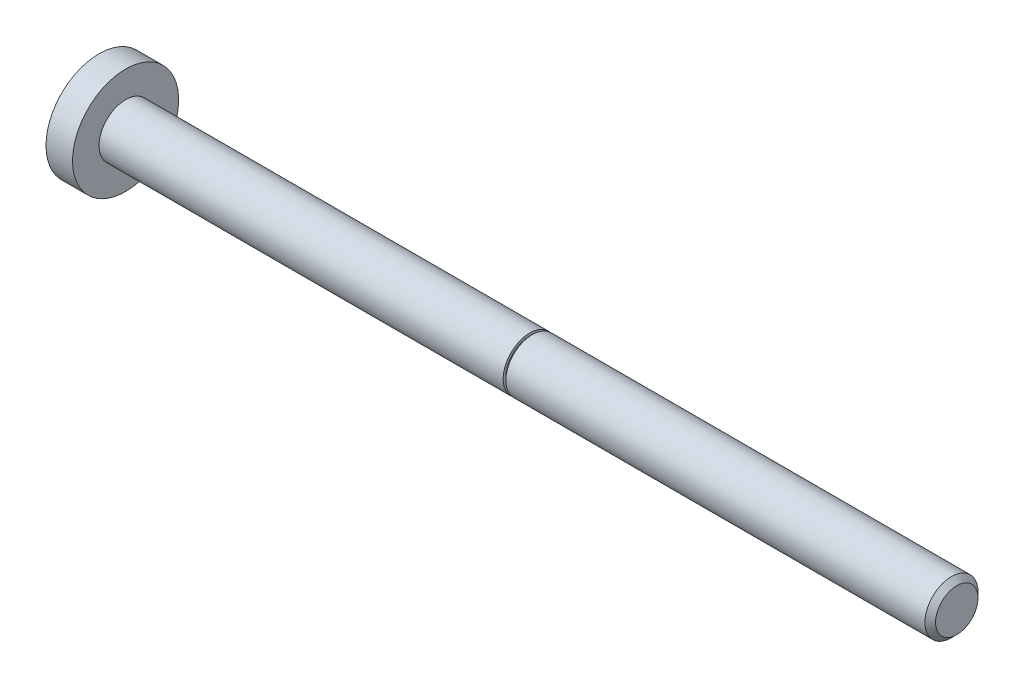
ISO-10303-21;
HEADER;
FILE_DESCRIPTION(('STEP AP214'),'2;1');
FILE_NAME('part.step','',(''),(''),'','','');
FILE_SCHEMA(('AUTOMOTIVE_DESIGN { 1 0 10303 214 1 1 1 1 }'));
ENDSEC;
DATA;
#1=APPLICATION_CONTEXT('core data for automotive mechanical design processes');
#2=APPLICATION_PROTOCOL_DEFINITION('international standard','automotive_design',2000,#1);
#3=PRODUCT_CONTEXT('',#1,'mechanical');
#4=PRODUCT('Part','Part','',(#3));
#5=PRODUCT_RELATED_PRODUCT_CATEGORY('part','',(#4));
#6=PRODUCT_DEFINITION_FORMATION('','',#4);
#7=PRODUCT_DEFINITION_CONTEXT('part definition',#1,'design');
#8=PRODUCT_DEFINITION('design','',#6,#7);
#9=PRODUCT_DEFINITION_SHAPE('','',#8);
#10=(LENGTH_UNIT() NAMED_UNIT(*) SI_UNIT(.MILLI.,.METRE.));
#11=(NAMED_UNIT(*) PLANE_ANGLE_UNIT() SI_UNIT($,.RADIAN.));
#12=(NAMED_UNIT(*) SI_UNIT($,.STERADIAN.) SOLID_ANGLE_UNIT());
#13=UNCERTAINTY_MEASURE_WITH_UNIT(LENGTH_MEASURE(1.E-05),#10,'distance_accuracy_value','');
#14=(GEOMETRIC_REPRESENTATION_CONTEXT(3) GLOBAL_UNCERTAINTY_ASSIGNED_CONTEXT((#13)) GLOBAL_UNIT_ASSIGNED_CONTEXT((#10,
#11,#12)) REPRESENTATION_CONTEXT('',''));
#15=CARTESIAN_POINT('',(0.,0.,0.));
#16=DIRECTION('',(0.,0.,1.));
#17=DIRECTION('',(1.,0.,0.));
#18=AXIS2_PLACEMENT_3D('',#15,#16,#17);
#19=CARTESIAN_POINT('',(-49.,0.,-6.));
#20=DIRECTION('',(1.,0.,0.));
#21=DIRECTION('',(0.,0.,-1.));
#22=AXIS2_PLACEMENT_3D('',#19,#20,#21);
#23=PLANE('',#22);
#24=CARTESIAN_POINT('',(-49.,0.,0.));
#25=DIRECTION('',(-1.,0.,0.));
#26=DIRECTION('',(0.,0.,1.));
#27=AXIS2_PLACEMENT_3D('',#24,#25,#26);
#28=CIRCLE('',#27,6.);
#29=CARTESIAN_POINT('',(-49.,0.,6.00000000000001));
#30=VERTEX_POINT('',#29);
#31=EDGE_CURVE('E53',#30,#30,#28,.T.);
#32=ORIENTED_EDGE('',*,*,#31,.T.);
#33=EDGE_LOOP('',(#32));
#34=FACE_BOUND('',#33,.T.);
#35=ADVANCED_FACE('F22',(#34),#23,.F.);
#36=CARTESIAN_POINT('',(48.,0.,-3.));
#37=DIRECTION('',(1.,0.,0.));
#38=DIRECTION('',(0.,0.,-1.));
#39=AXIS2_PLACEMENT_3D('',#36,#37,#38);
#40=PLANE('',#39);
#41=CARTESIAN_POINT('',(48.,0.,0.));
#42=DIRECTION('',(1.,0.,0.));
#43=DIRECTION('',(0.,0.,-1.));
#44=AXIS2_PLACEMENT_3D('',#41,#42,#43);
#45=CIRCLE('',#44,2.39999999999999);
#46=CARTESIAN_POINT('',(48.,0.,2.39999999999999));
#47=VERTEX_POINT('',#46);
#48=EDGE_CURVE('E10',#47,#47,#45,.T.);
#49=ORIENTED_EDGE('',*,*,#48,.T.);
#50=EDGE_LOOP('',(#49));
#51=FACE_BOUND('',#50,.T.);
#52=ADVANCED_FACE('F97',(#51),#40,.T.);
#53=CARTESIAN_POINT('',(0.,0.,0.));
#54=DIRECTION('',(-1.,0.,0.));
#55=DIRECTION('',(0.,0.,1.));
#56=AXIS2_PLACEMENT_3D('',#53,#54,#55);
#57=CYLINDRICAL_SURFACE('',#56,3.);
#58=CARTESIAN_POINT('',(47.4,0.,0.));
#59=DIRECTION('',(1.,0.,0.));
#60=DIRECTION('',(0.,0.,-1.));
#61=AXIS2_PLACEMENT_3D('',#58,#59,#60);
#62=CIRCLE('',#61,3.);
#63=CARTESIAN_POINT('',(47.4,0.,2.99999999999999));
#64=VERTEX_POINT('',#63);
#65=EDGE_CURVE('E28',#64,#64,#62,.F.);
#66=ORIENTED_EDGE('',*,*,#65,.T.);
#67=EDGE_LOOP('',(#66));
#68=FACE_BOUND('',#67,.T.);
#69=CARTESIAN_POINT('',(0.,0.,0.));
#70=DIRECTION('',(-1.,0.,0.));
#71=DIRECTION('',(0.,0.,1.));
#72=AXIS2_PLACEMENT_3D('',#69,#70,#71);
#73=CIRCLE('',#72,2.99999999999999);
#74=CARTESIAN_POINT('',(0.,0.,2.99999999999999));
#75=VERTEX_POINT('',#74);
#76=EDGE_CURVE('E32',#75,#75,#73,.T.);
#77=ORIENTED_EDGE('',*,*,#76,.F.);
#78=EDGE_LOOP('',(#77));
#79=FACE_BOUND('',#78,.T.);
#80=ADVANCED_FACE('F92',(#68,#79),#57,.T.);
#81=CARTESIAN_POINT('',(0.,0.,-2.99999999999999));
#82=DIRECTION('',(1.,0.,0.));
#83=DIRECTION('',(0.,0.,-1.));
#84=AXIS2_PLACEMENT_3D('',#81,#82,#83);
#85=PLANE('',#84);
#86=CARTESIAN_POINT('',(0.,0.,0.));
#87=DIRECTION('',(-1.,0.,0.));
#88=DIRECTION('',(0.,0.,1.));
#89=AXIS2_PLACEMENT_3D('',#86,#87,#88);
#90=CIRCLE('',#89,2.69999999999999);
#91=CARTESIAN_POINT('',(0.,0.,2.69999999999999));
#92=VERTEX_POINT('',#91);
#93=EDGE_CURVE('E36',#92,#92,#90,.T.);
#94=ORIENTED_EDGE('',*,*,#93,.F.);
#95=EDGE_LOOP('',(#94));
#96=FACE_BOUND('',#95,.T.);
#97=ORIENTED_EDGE('',*,*,#76,.T.);
#98=EDGE_LOOP('',(#97));
#99=FACE_BOUND('',#98,.T.);
#100=ADVANCED_FACE('F86',(#96,#99),#85,.F.);
#101=CARTESIAN_POINT('',(0.,0.,0.));
#102=DIRECTION('',(-1.,0.,0.));
#103=DIRECTION('',(0.,0.,1.));
#104=AXIS2_PLACEMENT_3D('',#101,#102,#103);
#105=CYLINDRICAL_SURFACE('',#104,2.69999999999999);
#106=CARTESIAN_POINT('',(-0.3,0.,0.));
#107=DIRECTION('',(-1.,0.,0.));
#108=DIRECTION('',(0.,0.,1.));
#109=AXIS2_PLACEMENT_3D('',#106,#107,#108);
#110=CIRCLE('',#109,2.69999999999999);
#111=CARTESIAN_POINT('',(-0.3,0.,2.69999999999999));
#112=VERTEX_POINT('',#111);
#113=EDGE_CURVE('E41',#112,#112,#110,.T.);
#114=ORIENTED_EDGE('',*,*,#113,.F.);
#115=EDGE_LOOP('',(#114));
#116=FACE_BOUND('',#115,.T.);
#117=ORIENTED_EDGE('',*,*,#93,.T.);
#118=EDGE_LOOP('',(#117));
#119=FACE_BOUND('',#118,.T.);
#120=ADVANCED_FACE('F80',(#116,#119),#105,.T.);
#121=CARTESIAN_POINT('',(-0.3,0.,-2.69999999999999));
#122=DIRECTION('',(-1.,0.,0.));
#123=DIRECTION('',(0.,0.,1.));
#124=AXIS2_PLACEMENT_3D('',#121,#122,#123);
#125=PLANE('',#124);
#126=CARTESIAN_POINT('',(-0.3,0.,0.));
#127=DIRECTION('',(-1.,0.,0.));
#128=DIRECTION('',(0.,0.,1.));
#129=AXIS2_PLACEMENT_3D('',#126,#127,#128);
#130=CIRCLE('',#129,2.99999999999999);
#131=CARTESIAN_POINT('',(-0.3,0.,2.99999999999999));
#132=VERTEX_POINT('',#131);
#133=EDGE_CURVE('E44',#132,#132,#130,.T.);
#134=ORIENTED_EDGE('',*,*,#133,.F.);
#135=EDGE_LOOP('',(#134));
#136=FACE_BOUND('',#135,.T.);
#137=ORIENTED_EDGE('',*,*,#113,.T.);
#138=EDGE_LOOP('',(#137));
#139=FACE_BOUND('',#138,.T.);
#140=ADVANCED_FACE('F74',(#136,#139),#125,.F.);
#141=CARTESIAN_POINT('',(0.,0.,0.));
#142=DIRECTION('',(-1.,0.,0.));
#143=DIRECTION('',(0.,0.,1.));
#144=AXIS2_PLACEMENT_3D('',#141,#142,#143);
#145=CYLINDRICAL_SURFACE('',#144,2.99999999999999);
#146=CARTESIAN_POINT('',(-46.,0.,0.));
#147=DIRECTION('',(-1.,0.,0.));
#148=DIRECTION('',(0.,0.,1.));
#149=AXIS2_PLACEMENT_3D('',#146,#147,#148);
#150=CIRCLE('',#149,2.99999999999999);
#151=CARTESIAN_POINT('',(-46.,0.,2.99999999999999));
#152=VERTEX_POINT('',#151);
#153=EDGE_CURVE('E47',#152,#152,#150,.T.);
#154=ORIENTED_EDGE('',*,*,#153,.F.);
#155=EDGE_LOOP('',(#154));
#156=FACE_BOUND('',#155,.T.);
#157=ORIENTED_EDGE('',*,*,#133,.T.);
#158=EDGE_LOOP('',(#157));
#159=FACE_BOUND('',#158,.T.);
#160=ADVANCED_FACE('F68',(#156,#159),#145,.T.);
#161=CARTESIAN_POINT('',(-46.,0.,-2.99999999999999));
#162=DIRECTION('',(-1.,0.,0.));
#163=DIRECTION('',(0.,0.,1.));
#164=AXIS2_PLACEMENT_3D('',#161,#162,#163);
#165=PLANE('',#164);
#166=CARTESIAN_POINT('',(-46.,0.,0.));
#167=DIRECTION('',(-1.,0.,0.));
#168=DIRECTION('',(0.,0.,1.));
#169=AXIS2_PLACEMENT_3D('',#166,#167,#168);
#170=CIRCLE('',#169,6.);
#171=CARTESIAN_POINT('',(-46.,0.,6.00000000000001));
#172=VERTEX_POINT('',#171);
#173=EDGE_CURVE('E50',#172,#172,#170,.T.);
#174=ORIENTED_EDGE('',*,*,#173,.F.);
#175=EDGE_LOOP('',(#174));
#176=FACE_BOUND('',#175,.T.);
#177=ORIENTED_EDGE('',*,*,#153,.T.);
#178=EDGE_LOOP('',(#177));
#179=FACE_BOUND('',#178,.T.);
#180=ADVANCED_FACE('F62',(#176,#179),#165,.F.);
#181=CARTESIAN_POINT('',(0.,0.,0.));
#182=DIRECTION('',(-1.,0.,0.));
#183=DIRECTION('',(0.,0.,1.));
#184=AXIS2_PLACEMENT_3D('',#181,#182,#183);
#185=CYLINDRICAL_SURFACE('',#184,6.);
#186=ORIENTED_EDGE('',*,*,#31,.F.);
#187=EDGE_LOOP('',(#186));
#188=FACE_BOUND('',#187,.T.);
#189=ORIENTED_EDGE('',*,*,#173,.T.);
#190=EDGE_LOOP('',(#189));
#191=FACE_BOUND('',#190,.T.);
#192=ADVANCED_FACE('F58',(#188,#191),#185,.T.);
#193=CARTESIAN_POINT('',(47.4,0.,0.));
#194=DIRECTION('',(-1.,0.,0.));
#195=DIRECTION('',(0.,0.,1.));
#196=AXIS2_PLACEMENT_3D('',#193,#194,#195);
#197=CONICAL_SURFACE('',#196,3.,0.785398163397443);
#198=CARTESIAN_POINT('',(48.,0.,2.39999999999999));
#199=CARTESIAN_POINT('',(47.99375,0.,2.40624999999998));
#200=CARTESIAN_POINT('',(47.9875,0.,2.41249999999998));
#201=CARTESIAN_POINT('',(47.975,0.,2.42499999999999));
#202=CARTESIAN_POINT('',(47.96875,0.,2.43124999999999));
#203=CARTESIAN_POINT('',(47.95625,0.,2.44374999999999));
#204=CARTESIAN_POINT('',(47.95,0.,2.44999999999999));
#205=CARTESIAN_POINT('',(47.9375,0.,2.46249999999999));
#206=CARTESIAN_POINT('',(47.93125,0.,2.46874999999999));
#207=CARTESIAN_POINT('',(47.91875,0.,2.48124999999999));
#208=CARTESIAN_POINT('',(47.9125,0.,2.48749999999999));
#209=CARTESIAN_POINT('',(47.9,0.,2.49999999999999));
#210=CARTESIAN_POINT('',(47.89375,0.,2.50624999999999));
#211=CARTESIAN_POINT('',(47.88125,0.,2.51874999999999));
#212=CARTESIAN_POINT('',(47.875,0.,2.52499999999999));
#213=CARTESIAN_POINT('',(47.8625,0.,2.53749999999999));
#214=CARTESIAN_POINT('',(47.85625,0.,2.54374999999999));
#215=CARTESIAN_POINT('',(47.84375,0.,2.55624999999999));
#216=CARTESIAN_POINT('',(47.8375,0.,2.56249999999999));
#217=CARTESIAN_POINT('',(47.825,0.,2.57499999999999));
#218=CARTESIAN_POINT('',(47.81875,0.,2.58124999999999));
#219=CARTESIAN_POINT('',(47.80625,0.,2.59374999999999));
#220=CARTESIAN_POINT('',(47.8,0.,2.59999999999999));
#221=CARTESIAN_POINT('',(47.7875,0.,2.61249999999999));
#222=CARTESIAN_POINT('',(47.78125,0.,2.61874999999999));
#223=CARTESIAN_POINT('',(47.76875,0.,2.63124999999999));
#224=CARTESIAN_POINT('',(47.7625,0.,2.63749999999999));
#225=CARTESIAN_POINT('',(47.75,0.,2.64999999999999));
#226=CARTESIAN_POINT('',(47.74375,0.,2.65624999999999));
#227=CARTESIAN_POINT('',(47.73125,0.,2.66874999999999));
#228=CARTESIAN_POINT('',(47.725,0.,2.67499999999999));
#229=CARTESIAN_POINT('',(47.7125,0.,2.68749999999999));
#230=CARTESIAN_POINT('',(47.70625,0.,2.69374999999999));
#231=CARTESIAN_POINT('',(47.69375,0.,2.70624999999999));
#232=CARTESIAN_POINT('',(47.6875,0.,2.71249999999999));
#233=CARTESIAN_POINT('',(47.675,0.,2.72499999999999));
#234=CARTESIAN_POINT('',(47.66875,0.,2.73124999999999));
#235=CARTESIAN_POINT('',(47.65625,0.,2.74374999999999));
#236=CARTESIAN_POINT('',(47.65,0.,2.74999999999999));
#237=CARTESIAN_POINT('',(47.6375,0.,2.76249999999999));
#238=CARTESIAN_POINT('',(47.63125,0.,2.76874999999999));
#239=CARTESIAN_POINT('',(47.61875,0.,2.78124999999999));
#240=CARTESIAN_POINT('',(47.6125,0.,2.78749999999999));
#241=CARTESIAN_POINT('',(47.6,0.,2.79999999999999));
#242=CARTESIAN_POINT('',(47.59375,0.,2.80624999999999));
#243=CARTESIAN_POINT('',(47.58125,0.,2.81874999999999));
#244=CARTESIAN_POINT('',(47.575,0.,2.82499999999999));
#245=CARTESIAN_POINT('',(47.5625,0.,2.83749999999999));
#246=CARTESIAN_POINT('',(47.55625,0.,2.84374999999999));
#247=CARTESIAN_POINT('',(47.54375,0.,2.85624999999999));
#248=CARTESIAN_POINT('',(47.5375,0.,2.86249999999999));
#249=CARTESIAN_POINT('',(47.525,0.,2.87499999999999));
#250=CARTESIAN_POINT('',(47.51875,0.,2.88124999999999));
#251=CARTESIAN_POINT('',(47.50625,0.,2.89374999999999));
#252=CARTESIAN_POINT('',(47.5,0.,2.89999999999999));
#253=CARTESIAN_POINT('',(47.4875,0.,2.91249999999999));
#254=CARTESIAN_POINT('',(47.48125,0.,2.91874999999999));
#255=CARTESIAN_POINT('',(47.46875,0.,2.93124999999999));
#256=CARTESIAN_POINT('',(47.4625,0.,2.93749999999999));
#257=CARTESIAN_POINT('',(47.45,0.,2.94999999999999));
#258=CARTESIAN_POINT('',(47.44375,0.,2.95624999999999));
#259=CARTESIAN_POINT('',(47.43125,0.,2.96874999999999));
#260=CARTESIAN_POINT('',(47.425,0.,2.97499999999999));
#261=CARTESIAN_POINT('',(47.4125,0.,2.98749999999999));
#262=CARTESIAN_POINT('',(47.40625,0.,2.99374999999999));
#263=CARTESIAN_POINT('',(47.4,0.,2.99999999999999));
#264=B_SPLINE_CURVE_WITH_KNOTS('',3,(#198,#199,#200,#201,#202,#203,#204,#205,#206,#207,#208,
#209,#210,#211,#212,#213,#214,#215,#216,#217,#218,#219,#220,#221,#222,#223,#224,#225,#226,#227,
#228,#229,#230,#231,#232,#233,#234,#235,#236,#237,#238,#239,#240,#241,#242,#243,#244,#245,#246,
#247,#248,#249,#250,#251,#252,#253,#254,#255,#256,#257,#258,#259,#260,#261,#262,#263),
.UNSPECIFIED.,.F.,.F.,(4,2,2,2,2,2,2,2,2,2,2,2,2,2,2,2,2,2,2,2,2,2,2,2,2,2,2,2,2,2,2,2,4),(0.,
0.0265165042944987,0.0530330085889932,0.0795495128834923,0.106066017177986,0.132582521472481,
0.15909902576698,0.185615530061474,0.212132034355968,0.238648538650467,0.265165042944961,
0.291681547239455,0.318198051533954,0.344714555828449,0.371231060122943,0.397747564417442,
0.424264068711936,0.45078057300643,0.477297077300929,0.503813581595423,0.530330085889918,
0.556846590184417,0.583363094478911,0.609879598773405,0.636396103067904,0.662912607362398,
0.689429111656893,0.715945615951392,0.742462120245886,0.76897862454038,0.795495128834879,
0.822011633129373,0.848528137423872),.UNSPECIFIED.);
#265=EDGE_CURVE('BSEAM61',#47,#64,#264,.T.);
#266=ORIENTED_EDGE('',*,*,#48,.F.);
#267=ORIENTED_EDGE('',*,*,#65,.F.);
#268=ORIENTED_EDGE('',*,*,#265,.T.);
#269=ORIENTED_EDGE('',*,*,#265,.F.);
#270=EDGE_LOOP('',(#266,#268,#267,#269));
#271=FACE_BOUND('',#270,.T.);
#272=ADVANCED_FACE('F61',(#271),#197,.T.);
#273=CLOSED_SHELL('',(#35,#52,#80,#100,#120,#140,#160,#180,#192,#272));
#274=MANIFOLD_SOLID_BREP('B2',#273);
#275=ADVANCED_BREP_SHAPE_REPRESENTATION('',(#18,#274),#14);
#276=SHAPE_DEFINITION_REPRESENTATION(#9,#275);
ENDSEC;
END-ISO-10303-21;
